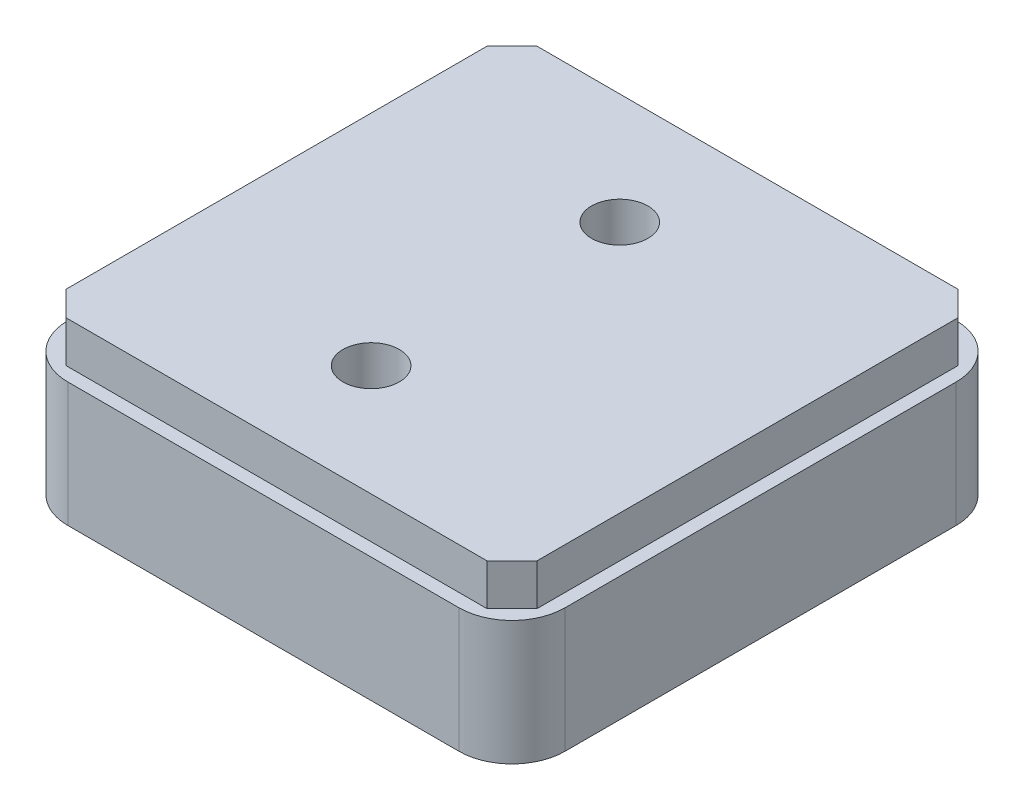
from build123d import *

# Parameters (mm, degrees)
EL_MENT_M_CANO_SOUD_1_DEPTH = 20
EMBOUT1_WIDTH               = 56.8
EMBOUT1_HEIGHT              = 56.8
EMBOUT1_THICKNESS           = 5
EMBOUT1_2_SIZE              = 3
ESQUISSE4_W                 = 3.4
ESQUISSE4_H                 = 5
TROU_TARAUD_M81_AT_2_COUNT  = 2
TROU_TARAUD_M81_AT_2_PITCH  = 30


with BuildPart() as part:
    # Sketch1 → El_ment m_cano-soud_1 (new body)
    with BuildSketch(Plane(origin=(0, 0, 0), x_dir=(-1, 0, 0), z_dir=(0, 1, 0))):
        with BuildLine():
            Line((-23.6, -30), (23.6, -30))
            ThreePointArc((23.6, -30), (28.1254834, -28.1254834), (30, -23.6))
            Line((30, -23.6), (30, 23.6))
            ThreePointArc((30, 23.6), (28.1254834, 28.1254834), (23.6, 30))
            Line((23.6, 30), (-23.6, 30))
            ThreePointArc((-23.6, 30), (-28.1254834, 28.1254834), (-30, 23.6))
            Line((-30, 23.6), (-30, -23.6))
            ThreePointArc((-30, -23.6), (-28.1254834, -28.1254834), (-23.6, -30))
        make_face()
        with BuildLine():
            Line((-23.6, -26.8), (23.6, -26.8))
            ThreePointArc((23.6, -26.8), (25.8627417, -25.8627417), (26.8, -23.6))
            Line((26.8, -23.6), (26.8, 23.6))
            ThreePointArc((26.8, 23.6), (25.8627417, 25.8627417), (23.6, 26.8))
            Line((23.6, 26.8), (-23.6, 26.8))
            ThreePointArc((-23.6, 26.8), (-25.8627417, 25.8627417), (-26.8, 23.6))
            Line((-26.8, 23.6), (-26.8, -23.6))
            ThreePointArc((-26.8, -23.6), (-25.8627417, -25.8627417), (-23.6, -26.8))
        make_face(mode=Mode.SUBTRACT)
    extrude(amount=EL_MENT_M_CANO_SOUD_1_DEPTH)

    # Embout1 3
    split(bisect_by=Plane.XZ.offset(-15), keep=Keep.TOP)


with BuildPart() as body_2:
    # Embout1: an end cap: a rectangular plate 5.0 thick over the member's open end
    with BuildSketch(Plane(origin=(0, 20, 0), x_dir=(-1, 0, 0), z_dir=(0, 1, 0))):
        Rectangle(EMBOUT1_WIDTH, EMBOUT1_HEIGHT)
    extrude(amount=-EMBOUT1_THICKNESS)

    # Embout1 2
    embout1_2_edges = [body_2.edges().sort_by_distance(p)[0] for p in [
        (28.4, 17.5, -28.4),
        (28.4, 17.5, 28.4),
        (-28.4, 17.5, -28.4),
        (-28.4, 17.5, 28.4),
    ]]
    chamfer(embout1_2_edges, length=EMBOUT1_2_SIZE)

    # Esquisse4 → Trou taraud_ M81 (revolve, cut)
    with BuildSketch(Plane(origin=(-2, 20, -15), x_dir=(0, 0, 1), z_dir=(1, 0, 0))):
        with Locations((1.7, 2.5)):
            Rectangle(ESQUISSE4_W, ESQUISSE4_H)
    trou_taraud_m81 = revolve(axis=Axis((-2, 26.35, -15), (0, -1, 0)), mode=Mode.SUBTRACT)

    # Trou taraud_ M81 at 2: Trou taraud_ M81 ×2
    with Locations(*[(0, 0, i * TROU_TARAUD_M81_AT_2_PITCH) for i in range(1, TROU_TARAUD_M81_AT_2_COUNT)]):
        add(trou_taraud_m81, mode=Mode.SUBTRACT)


solid = Compound([part.part, body_2.part])
